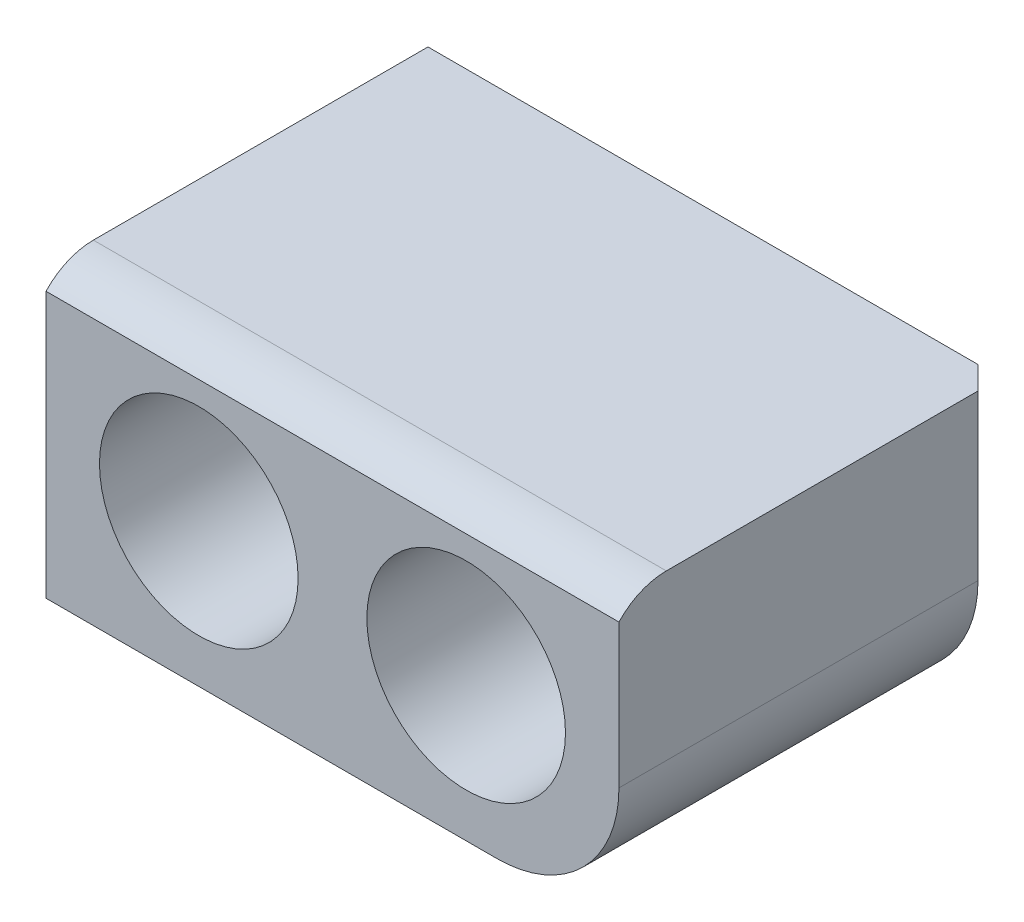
from build123d import *

# Parameters (mm, degrees)
SKETCH3_W             = 19.05
SKETCH3_H             = 9.525
EXTRUDE1_DEPTH        = 12.7
FILLET1_R             = 4.064
F_6_CBORE_D           = 4.318
F_6_CBORE_CBORE_D     = 6.604
F_6_CBORE_CBORE_DEPTH = 4.826
CUT_EXTRUDE1_DEPTH    = 25.797542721
CHAMFER1_SIZE         = 0.762


with BuildPart() as part:
    # Sketch3 → Extrude1 (new body)
    with BuildSketch(Plane.XY):
        with Locations((9.525, -4.7625)):
            Rectangle(SKETCH3_W, SKETCH3_H)
    extrude(amount=-EXTRUDE1_DEPTH)

    # Fillet1
    fillet1_edges = [part.edges().sort_by_distance(p)[0] for p in [
        (19.05, -9.525, -6.35),
    ]]
    fillet(fillet1_edges, radius=FILLET1_R)

    # 6 CBORE (through all)
    with Locations(Plane.XY):
        with Locations((5.08, -4.7625), (13.97, -4.7625)):
            CounterBoreHole(F_6_CBORE_D / 2, F_6_CBORE_CBORE_D / 2, F_6_CBORE_CBORE_DEPTH)

    # Sketch6 → Cut-Extrude1 (cut, through all)
    with BuildSketch(Plane.ZY):
        with BuildLine():
            Line((0, -0.685077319), (0.9652, -0.685077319))
            Line((0.9652, -0.685077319), (0.9652, 0.584922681))
            Line((0.9652, 0.584922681), (-1.5748, 0.584922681))
            Line((-1.5748, 0.584922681), (-1.5748, 0))
            ThreePointArc((-1.5748, 0), (-0.716119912, -0.178685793), (0, -0.685077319))
        make_face()
    extrude(amount=-CUT_EXTRUDE1_DEPTH, mode=Mode.SUBTRACT)

    # Chamfer1
    chamfer1_edges = [part.edges().sort_by_distance(p)[0] for p in [
        (19.05, -2.7305, -12.7),
        (17.859681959, -8.334681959, -12.7),
        (7.493, -9.525, -12.7),
    ]]
    chamfer(chamfer1_edges, length=CHAMFER1_SIZE)


solid = part.part
